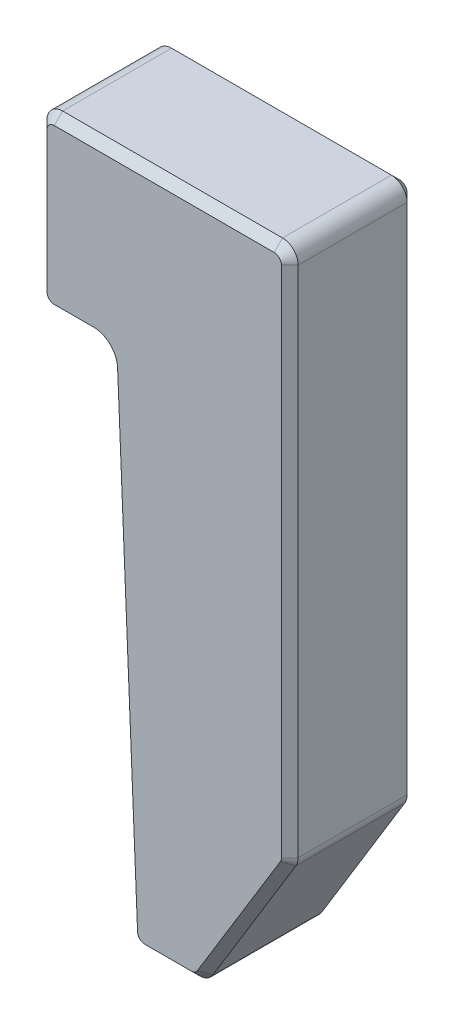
from build123d import *

# Parameters (mm, degrees)
EXTRUDE_1_DEPTH = 3
CHAMFER_1_SIZE  = 0.2


with BuildPart() as part:
    # Sketch 1 → Extrude 1 (new body)
    with BuildSketch(Plane.XY):
        with BuildLine():
            Line((-0.014998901, 0.359362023), (-0.492112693, 11.790637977))
            ThreePointArc((-0.492112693, 11.790637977), (-0.607209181, 12.045637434), (-0.86678649, 12.15))
            Line((-0.86678649, 12.15), (-1.805, 12.15))
            ThreePointArc((-1.805, 12.15), (-2.070165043, 12.259834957), (-2.18, 12.525))
            Line((-2.18, 12.525), (-2.18, 15.875))
            ThreePointArc((-2.18, 15.875), (-2.070165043, 16.140165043), (-1.805, 16.25))
            Line((-1.805, 16.25), (3.445, 16.25))
            ThreePointArc((3.445, 16.25), (3.710165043, 16.140165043), (3.82, 15.875))
            Line((3.82, 15.875), (3.82, 3.61948186))
            ThreePointArc((3.82, 3.61948186), (3.806009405, 3.518006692), (3.765081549, 3.424103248))
            Line((3.765081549, 3.424103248), (1.784641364, 0.179621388))
            ThreePointArc((1.784641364, 0.179621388), (1.648078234, 0.047974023), (1.464559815, 0))
            Line((1.464559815, 0), (0.359674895, 0))
            ThreePointArc((0.359674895, 0), (0.100097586, 0.104362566), (-0.014998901, 0.359362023))
        make_face()
    extrude(amount=EXTRUDE_1_DEPTH)

    # Chamfer 1
    chamfer_1_edges = [part.edges().sort_by_distance(p)[0] for p in [
        (3.710165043, 16.140165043, 3),
        (2.774861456, 1.801862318, 0),
        (1.648078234, 0.047974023, 0),
        (0.82, 16.25, 3),
        (0.912117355, 0, 0),
        (0.100097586, 0.104362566, 0),
        (-0.253555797, 6.075, 0),
        (-0.607209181, 12.045637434, 0),
        (-1.335893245, 12.15, 0),
        (-2.070165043, 12.259834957, 0),
        (-2.18, 14.2, 0),
        (-2.070165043, 16.140165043, 3),
        (-2.070165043, 16.140165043, 0),
        (0.82, 16.25, 0),
        (3.710165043, 16.140165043, 0),
        (3.82, 9.74724093, 0),
        (3.806009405, 3.518006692, 0),
        (-2.18, 14.2, 3),
        (-2.070165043, 12.259834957, 3),
        (-1.335893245, 12.15, 3),
        (-0.607209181, 12.045637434, 3),
        (-0.253555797, 6.075, 3),
        (0.100097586, 0.104362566, 3),
        (0.912117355, 0, 3),
        (3.806009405, 3.518006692, 3),
        (1.648078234, 0.047974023, 3),
        (2.774861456, 1.801862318, 3),
        (3.82, 9.74724093, 3),
    ]]
    chamfer(chamfer_1_edges, length=CHAMFER_1_SIZE)


solid = part.part
